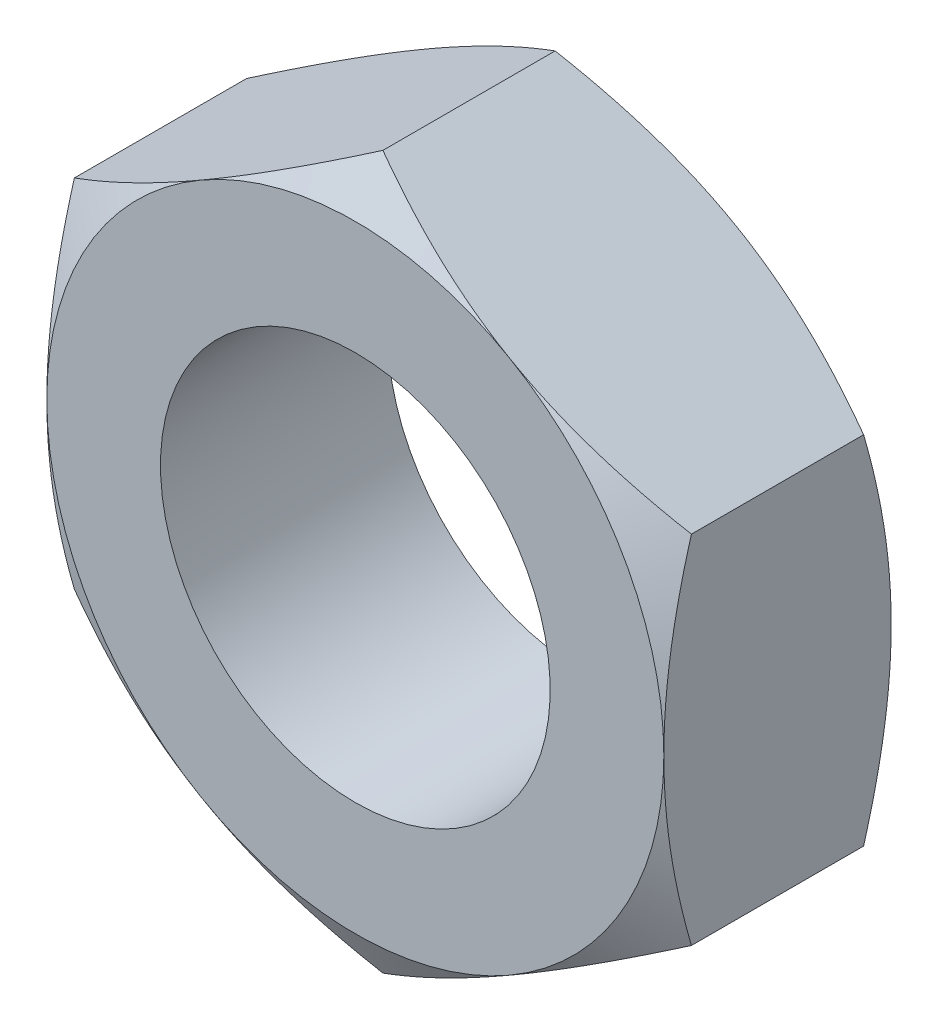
ISO-10303-21;
HEADER;
FILE_DESCRIPTION(('STEP AP214'),'2;1');
FILE_NAME('part.step','',(''),(''),'','','');
FILE_SCHEMA(('AUTOMOTIVE_DESIGN { 1 0 10303 214 1 1 1 1 }'));
ENDSEC;
DATA;
#1=APPLICATION_CONTEXT('core data for automotive mechanical design processes');
#2=APPLICATION_PROTOCOL_DEFINITION('international standard','automotive_design',2000,#1);
#3=PRODUCT_CONTEXT('',#1,'mechanical');
#4=PRODUCT('Part','Part','',(#3));
#5=PRODUCT_RELATED_PRODUCT_CATEGORY('part','',(#4));
#6=PRODUCT_DEFINITION_FORMATION('','',#4);
#7=PRODUCT_DEFINITION_CONTEXT('part definition',#1,'design');
#8=PRODUCT_DEFINITION('design','',#6,#7);
#9=PRODUCT_DEFINITION_SHAPE('','',#8);
#10=(LENGTH_UNIT() NAMED_UNIT(*) SI_UNIT(.MILLI.,.METRE.));
#11=(NAMED_UNIT(*) PLANE_ANGLE_UNIT() SI_UNIT($,.RADIAN.));
#12=(NAMED_UNIT(*) SI_UNIT($,.STERADIAN.) SOLID_ANGLE_UNIT());
#13=UNCERTAINTY_MEASURE_WITH_UNIT(LENGTH_MEASURE(1.E-05),#10,'distance_accuracy_value','');
#14=(GEOMETRIC_REPRESENTATION_CONTEXT(3) GLOBAL_UNCERTAINTY_ASSIGNED_CONTEXT((#13)) GLOBAL_UNIT_ASSIGNED_CONTEXT((#10,
#11,#12)) REPRESENTATION_CONTEXT('',''));
#15=CARTESIAN_POINT('',(0.,0.,0.));
#16=DIRECTION('',(0.,0.,1.));
#17=DIRECTION('',(1.,0.,0.));
#18=AXIS2_PLACEMENT_3D('',#15,#16,#17);
#19=CARTESIAN_POINT('',(-9.5,-5.48482755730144,10.));
#20=DIRECTION('',(-1.,0.,0.));
#21=DIRECTION('',(0.,0.,1.));
#22=AXIS2_PLACEMENT_3D('',#19,#20,#21);
#23=PLANE('',#22);
#24=CARTESIAN_POINT('',(-9.5,-14.7001628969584,4.62036564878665));
#25=CARTESIAN_POINT('',(-9.5,-14.4928471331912,4.519839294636));
#26=CARTESIAN_POINT('',(-9.5,-14.2852872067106,4.41981671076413));
#27=CARTESIAN_POINT('',(-9.5,-13.869628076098,4.22089324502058));
#28=CARTESIAN_POINT('',(-9.5,-13.6615288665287,4.12199237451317));
#29=CARTESIAN_POINT('',(-9.5,-13.0362900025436,3.82711729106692));
#30=CARTESIAN_POINT('',(-9.5,-12.6182709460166,3.6330006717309));
#31=CARTESIAN_POINT('',(-9.5,-11.7771337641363,3.24984888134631));
#32=CARTESIAN_POINT('',(-9.5,-11.354000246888,3.06084741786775));
#33=CARTESIAN_POINT('',(-9.5,-10.5043570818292,2.69061968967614));
#34=CARTESIAN_POINT('',(-9.5,-10.0778475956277,2.50939305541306));
#35=CARTESIAN_POINT('',(-9.5,-9.20711708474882,2.15115514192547));
#36=CARTESIAN_POINT('',(-9.5,-8.76276452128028,1.97446181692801));
#37=CARTESIAN_POINT('',(-9.5,-7.86884975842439,1.63452719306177));
#38=CARTESIAN_POINT('',(-9.5,-7.41928697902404,1.47128740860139));
#39=CARTESIAN_POINT('',(-9.5,-6.51508321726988,1.16257016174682));
#40=CARTESIAN_POINT('',(-9.5,-6.06045474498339,1.01705645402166));
#41=CARTESIAN_POINT('',(-9.5,-5.14469290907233,0.748480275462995));
#42=CARTESIAN_POINT('',(-9.5,-4.68356165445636,0.625410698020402));
#43=CARTESIAN_POINT('',(-9.5,-3.75701738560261,0.408313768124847));
#44=CARTESIAN_POINT('',(-9.5,-3.2916421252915,0.31412965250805));
#45=CARTESIAN_POINT('',(-9.5,-2.58936761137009,0.198609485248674));
#46=CARTESIAN_POINT('',(-9.5,-2.3545566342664,0.164393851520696));
#47=CARTESIAN_POINT('',(-9.5,-1.88377870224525,0.105219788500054));
#48=CARTESIAN_POINT('',(-9.5,-1.64781186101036,0.0802604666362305));
#49=CARTESIAN_POINT('',(-9.5,-1.17810612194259,0.0404075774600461));
#50=CARTESIAN_POINT('',(-9.5,-0.944377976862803,0.0253877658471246));
#51=CARTESIAN_POINT('',(-9.5,-0.476496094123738,0.00524322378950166));
#52=CARTESIAN_POINT('',(-9.5,-0.242342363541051,0.000118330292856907));
#53=CARTESIAN_POINT('',(-9.5,0.225972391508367,-0.000114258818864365));
#54=CARTESIAN_POINT('',(-9.5,0.460133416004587,0.00477809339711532));
#55=CARTESIAN_POINT('',(-9.5,0.928042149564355,0.0244611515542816));
#56=CARTESIAN_POINT('',(-9.5,1.16178983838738,0.03925232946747));
#57=CARTESIAN_POINT('',(-9.5,1.72456481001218,0.0864680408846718));
#58=CARTESIAN_POINT('',(-9.5,2.05320029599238,0.12364510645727));
#59=CARTESIAN_POINT('',(-9.5,2.7080124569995,0.215533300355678));
#60=CARTESIAN_POINT('',(-9.5,3.03418878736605,0.270246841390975));
#61=CARTESIAN_POINT('',(-9.5,3.68377887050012,0.395261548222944));
#62=CARTESIAN_POINT('',(-9.5,4.0071902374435,0.465574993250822));
#63=CARTESIAN_POINT('',(-9.5,4.65075897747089,0.619645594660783));
#64=CARTESIAN_POINT('',(-9.5,4.97091640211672,0.703402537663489));
#65=CARTESIAN_POINT('',(-9.5,5.61497508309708,0.884291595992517));
#66=CARTESIAN_POINT('',(-9.5,5.93880489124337,0.981676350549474));
#67=CARTESIAN_POINT('',(-9.5,6.58327415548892,1.18643170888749));
#68=CARTESIAN_POINT('',(-9.5,6.90391359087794,1.29380237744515));
#69=CARTESIAN_POINT('',(-9.5,7.54216168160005,1.51683145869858));
#70=CARTESIAN_POINT('',(-9.5,7.85977132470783,1.63248705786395));
#71=CARTESIAN_POINT('',(-9.5,8.49236415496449,1.87073285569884));
#72=CARTESIAN_POINT('',(-9.5,8.80734736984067,1.99332298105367));
#73=CARTESIAN_POINT('',(-9.5,9.53798536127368,2.28547163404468));
#74=CARTESIAN_POINT('',(-9.5,9.95275460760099,2.45724117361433));
#75=CARTESIAN_POINT('',(-9.5,10.778861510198,2.80886574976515));
#76=CARTESIAN_POINT('',(-9.5,11.1901989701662,2.98872124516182));
#77=CARTESIAN_POINT('',(-9.5,12.0100639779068,3.3549345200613));
#78=CARTESIAN_POINT('',(-9.5,12.4185909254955,3.54129363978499));
#79=CARTESIAN_POINT('',(-9.5,13.2332072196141,3.9192325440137));
#80=CARTESIAN_POINT('',(-9.5,13.6392966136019,4.11081222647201));
#81=CARTESIAN_POINT('',(-9.5,14.4498532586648,4.49843576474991));
#82=CARTESIAN_POINT('',(-9.5,14.8543183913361,4.69448404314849));
#83=CARTESIAN_POINT('',(-9.5,15.6615189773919,5.09010804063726));
#84=CARTESIAN_POINT('',(-9.5,16.0642544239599,5.2896837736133));
#85=CARTESIAN_POINT('',(-9.5,17.2701751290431,5.89273467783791));
#86=CARTESIAN_POINT('',(-9.5,18.0711740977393,6.30058144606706));
#87=CARTESIAN_POINT('',(-9.5,19.6039406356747,7.09102572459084));
#88=CARTESIAN_POINT('',(-9.5,20.3360415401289,7.47297970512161));
#89=CARTESIAN_POINT('',(-9.5,21.7974964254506,8.24216123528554));
#90=CARTESIAN_POINT('',(-9.5,22.5268503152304,8.62938895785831));
#91=CARTESIAN_POINT('',(-9.5,23.9816684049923,9.40694561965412));
#92=CARTESIAN_POINT('',(-9.5,24.7071377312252,9.79726498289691));
#93=CARTESIAN_POINT('',(-9.5,26.1563120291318,10.5810756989));
#94=CARTESIAN_POINT('',(-9.5,26.8800170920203,10.9745668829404));
#95=CARTESIAN_POINT('',(-9.5,27.6030690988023,11.3692463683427));
#96=B_SPLINE_CURVE_WITH_KNOTS('',3,(#24,#25,#26,#27,#28,#29,#30,#31,#32,#33,#34,#35,#36,#37,#38,
#39,#40,#41,#42,#43,#44,#45,#46,#47,#48,#49,#50,#51,#52,#53,#54,#55,#56,#57,#58,#59,#60,#61,#62,
#63,#64,#65,#66,#67,#68,#69,#70,#71,#72,#73,#74,#75,#76,#77,#78,#79,#80,#81,#82,#83,#84,#85,#86,
#87,#88,#89,#90,#91,#92,#93,#94,#95),.UNSPECIFIED.,.F.,.F.,(4,2,2,2,2,2,2,2,2,2,2,2,2,2,2,2,2,2,
2,2,2,2,2,2,2,2,2,2,2,2,2,2,2,2,2,4),(0.,0.691206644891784,1.38242028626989,2.76505382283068,
4.1552702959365,5.54542061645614,6.97983441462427,8.41440945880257,9.84600008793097,
11.2771366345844,12.7003629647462,13.4120814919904,14.1237313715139,14.8261594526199,
15.5285759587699,16.2309958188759,16.9334491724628,17.9250946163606,18.9168765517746,
19.909441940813,20.9019915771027,21.916267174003,22.9305493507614,23.9444886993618,
24.9584173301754,26.3050929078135,27.6518449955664,28.9988762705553,30.3458812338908,
31.6942827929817,33.0426896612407,35.739172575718,38.2163950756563,40.693699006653,
43.165106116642,45.6363826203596),.UNSPECIFIED.);
#97=CARTESIAN_POINT('',(-9.5,-5.48482755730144,0.848505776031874));
#98=VERTEX_POINT('',#97);
#99=CARTESIAN_POINT('',(-9.5,0.,0.));
#100=VERTEX_POINT('',#99);
#101=EDGE_CURVE('E137',#98,#100,#96,.T.);
#102=ORIENTED_EDGE('',*,*,#101,.F.);
#103=DIRECTION('',(0.,0.,-1.));
#104=VECTOR('',#103,1.);
#105=CARTESIAN_POINT('',(-9.5,-5.48482755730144,10.));
#106=LINE('',#105,#104);
#107=CARTESIAN_POINT('',(-9.5,-5.48482755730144,6.15149422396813));
#108=VERTEX_POINT('',#107);
#109=EDGE_CURVE('E266',#108,#98,#106,.T.);
#110=ORIENTED_EDGE('',*,*,#109,.F.);
#111=CARTESIAN_POINT('',(-9.5,-14.7001628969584,2.37963435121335));
#112=CARTESIAN_POINT('',(-9.5,-14.4928471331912,2.48016070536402));
#113=CARTESIAN_POINT('',(-9.5,-14.2852872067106,2.58018328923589));
#114=CARTESIAN_POINT('',(-9.5,-13.869628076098,2.77910675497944));
#115=CARTESIAN_POINT('',(-9.5,-13.6615288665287,2.87800762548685));
#116=CARTESIAN_POINT('',(-9.5,-13.0362900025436,3.1728827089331));
#117=CARTESIAN_POINT('',(-9.5,-12.6182709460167,3.36699932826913));
#118=CARTESIAN_POINT('',(-9.5,-11.7771337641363,3.75015111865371));
#119=CARTESIAN_POINT('',(-9.5,-11.354000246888,3.93915258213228));
#120=CARTESIAN_POINT('',(-9.5,-10.5043570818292,4.30938031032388));
#121=CARTESIAN_POINT('',(-9.5,-10.0778475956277,4.49060694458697));
#122=CARTESIAN_POINT('',(-9.5,-9.20711708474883,4.84884485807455));
#123=CARTESIAN_POINT('',(-9.5,-8.76276452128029,5.02553818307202));
#124=CARTESIAN_POINT('',(-9.5,-7.8688497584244,5.36547280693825));
#125=CARTESIAN_POINT('',(-9.5,-7.41928697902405,5.52871259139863));
#126=CARTESIAN_POINT('',(-9.5,-6.5150832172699,5.8374298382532));
#127=CARTESIAN_POINT('',(-9.5,-6.06045474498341,5.98294354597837));
#128=CARTESIAN_POINT('',(-9.5,-5.14469290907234,6.25151972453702));
#129=CARTESIAN_POINT('',(-9.5,-4.68356165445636,6.3745893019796));
#130=CARTESIAN_POINT('',(-9.5,-3.75701738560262,6.59168623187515));
#131=CARTESIAN_POINT('',(-9.5,-3.2916421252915,6.68587034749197));
#132=CARTESIAN_POINT('',(-9.5,-2.5893676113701,6.80139051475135));
#133=CARTESIAN_POINT('',(-9.5,-2.3545566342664,6.83560614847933));
#134=CARTESIAN_POINT('',(-9.5,-1.88377870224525,6.89478021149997));
#135=CARTESIAN_POINT('',(-9.5,-1.64781186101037,6.91973953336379));
#136=CARTESIAN_POINT('',(-9.5,-1.17810612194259,6.95959242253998));
#137=CARTESIAN_POINT('',(-9.5,-0.944377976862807,6.9746122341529));
#138=CARTESIAN_POINT('',(-9.5,-0.476496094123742,6.99475677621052));
#139=CARTESIAN_POINT('',(-9.5,-0.242342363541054,6.99988166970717));
#140=CARTESIAN_POINT('',(-9.5,0.225972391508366,7.00011425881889));
#141=CARTESIAN_POINT('',(-9.5,0.460133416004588,6.99522190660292));
#142=CARTESIAN_POINT('',(-9.5,0.928042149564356,6.97553884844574));
#143=CARTESIAN_POINT('',(-9.5,1.16178983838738,6.96074767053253));
#144=CARTESIAN_POINT('',(-9.5,1.72456481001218,6.91353195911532));
#145=CARTESIAN_POINT('',(-9.5,2.05320029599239,6.87635489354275));
#146=CARTESIAN_POINT('',(-9.5,2.70801245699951,6.78446669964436));
#147=CARTESIAN_POINT('',(-9.5,3.03418878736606,6.72975315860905));
#148=CARTESIAN_POINT('',(-9.5,3.68377887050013,6.60473845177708));
#149=CARTESIAN_POINT('',(-9.5,4.00719023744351,6.5344250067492));
#150=CARTESIAN_POINT('',(-9.5,4.6507589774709,6.38035440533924));
#151=CARTESIAN_POINT('',(-9.5,4.97091640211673,6.29659746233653));
#152=CARTESIAN_POINT('',(-9.5,5.61497508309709,6.11570840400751));
#153=CARTESIAN_POINT('',(-9.5,5.93880489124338,6.01832364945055));
#154=CARTESIAN_POINT('',(-9.5,6.58327415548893,5.81356829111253));
#155=CARTESIAN_POINT('',(-9.5,6.90391359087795,5.70619762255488));
#156=CARTESIAN_POINT('',(-9.5,7.54216168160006,5.48316854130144));
#157=CARTESIAN_POINT('',(-9.5,7.85977132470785,5.36751294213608));
#158=CARTESIAN_POINT('',(-9.5,8.4923641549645,5.12926714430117));
#159=CARTESIAN_POINT('',(-9.5,8.80734736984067,5.00667701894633));
#160=CARTESIAN_POINT('',(-9.5,9.53798536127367,4.71452836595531));
#161=CARTESIAN_POINT('',(-9.5,9.95275460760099,4.54275882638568));
#162=CARTESIAN_POINT('',(-9.5,10.778861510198,4.19113425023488));
#163=CARTESIAN_POINT('',(-9.5,11.1901989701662,4.0112787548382));
#164=CARTESIAN_POINT('',(-9.5,12.0100639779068,3.64506547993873));
#165=CARTESIAN_POINT('',(-9.5,12.4185909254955,3.45870636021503));
#166=CARTESIAN_POINT('',(-9.5,13.2332072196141,3.08076745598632));
#167=CARTESIAN_POINT('',(-9.5,13.639296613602,2.88918777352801));
#168=CARTESIAN_POINT('',(-9.5,14.4498532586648,2.50156423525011));
#169=CARTESIAN_POINT('',(-9.5,14.8543183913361,2.30551595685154));
#170=CARTESIAN_POINT('',(-9.5,15.6615189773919,1.90989195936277));
#171=CARTESIAN_POINT('',(-9.5,16.0642544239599,1.71031622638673));
#172=CARTESIAN_POINT('',(-9.5,17.2701751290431,1.10726532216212));
#173=CARTESIAN_POINT('',(-9.5,18.0711740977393,0.699418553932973));
#174=CARTESIAN_POINT('',(-9.5,19.6039406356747,-0.0910257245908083));
#175=CARTESIAN_POINT('',(-9.5,20.3360415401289,-0.472979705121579));
#176=CARTESIAN_POINT('',(-9.5,21.7974964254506,-1.24216123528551));
#177=CARTESIAN_POINT('',(-9.5,22.5268503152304,-1.62938895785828));
#178=CARTESIAN_POINT('',(-9.5,23.9816684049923,-2.40694561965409));
#179=CARTESIAN_POINT('',(-9.5,24.7071377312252,-2.79726498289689));
#180=CARTESIAN_POINT('',(-9.5,26.1563120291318,-3.58107569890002));
#181=CARTESIAN_POINT('',(-9.5,26.8800170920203,-3.97456688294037));
#182=CARTESIAN_POINT('',(-9.5,27.6030690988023,-4.36924636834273));
#183=B_SPLINE_CURVE_WITH_KNOTS('',3,(#111,#112,#113,#114,#115,#116,#117,#118,#119,#120,#121,
#122,#123,#124,#125,#126,#127,#128,#129,#130,#131,#132,#133,#134,#135,#136,#137,#138,#139,#140,
#141,#142,#143,#144,#145,#146,#147,#148,#149,#150,#151,#152,#153,#154,#155,#156,#157,#158,#159,
#160,#161,#162,#163,#164,#165,#166,#167,#168,#169,#170,#171,#172,#173,#174,#175,#176,#177,#178,
#179,#180,#181,#182),.UNSPECIFIED.,.F.,.F.,(4,2,2,2,2,2,2,2,2,2,2,2,2,2,2,2,2,2,2,2,2,2,2,2,2,2,
2,2,2,2,2,2,2,2,2,4),(0.,0.691206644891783,1.38242028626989,2.76505382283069,4.1552702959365,
5.54542061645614,6.97983441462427,8.41440945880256,9.84600008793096,11.2771366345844,
12.7003629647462,13.4120814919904,14.1237313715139,14.8261594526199,15.5285759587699,
16.2309958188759,16.9334491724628,17.9250946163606,18.9168765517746,19.909441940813,
20.9019915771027,21.916267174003,22.9305493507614,23.9444886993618,24.9584173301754,
26.3050929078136,27.6518449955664,28.9988762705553,30.3458812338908,31.6942827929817,
33.0426896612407,35.739172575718,38.2163950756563,40.693699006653,43.165106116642,
45.6363826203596),.UNSPECIFIED.);
#184=CARTESIAN_POINT('',(-9.5,0.,7.));
#185=VERTEX_POINT('',#184);
#186=EDGE_CURVE('E220',#185,#108,#183,.F.);
#187=ORIENTED_EDGE('',*,*,#186,.F.);
#188=CARTESIAN_POINT('',(-9.5,5.48482755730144,6.15149422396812));
#189=VERTEX_POINT('',#188);
#190=EDGE_CURVE('E206',#189,#185,#183,.F.);
#191=ORIENTED_EDGE('',*,*,#190,.F.);
#192=DIRECTION('',(0.,0.,-1.));
#193=VECTOR('',#192,1.);
#194=CARTESIAN_POINT('',(-9.5,5.48482755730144,10.));
#195=LINE('',#194,#193);
#196=CARTESIAN_POINT('',(-9.5,5.48482755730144,0.848505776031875));
#197=VERTEX_POINT('',#196);
#198=EDGE_CURVE('E260',#189,#197,#195,.T.);
#199=ORIENTED_EDGE('',*,*,#198,.T.);
#200=EDGE_CURVE('E115',#100,#197,#96,.T.);
#201=ORIENTED_EDGE('',*,*,#200,.F.);
#202=EDGE_LOOP('',(#102,#110,#187,#191,#199,#201));
#203=FACE_BOUND('',#202,.T.);
#204=ADVANCED_FACE('F14',(#203),#23,.T.);
#205=CARTESIAN_POINT('',(-9.5,-5.48482755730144,10.));
#206=DIRECTION('',(0.5,0.86602540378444,0.));
#207=DIRECTION('',(-0.86602540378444,0.5,0.));
#208=AXIS2_PLACEMENT_3D('',#205,#206,#207);
#209=PLANE('',#208);
#210=ORIENTED_EDGE('',*,*,#109,.T.);
#211=CARTESIAN_POINT('',(-9.5002,-5.4847120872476,0.848572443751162));
#212=CARTESIAN_POINT('',(-9.2913692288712,-5.60528058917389,0.778973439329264));
#213=CARTESIAN_POINT('',(-9.08175982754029,-5.72629863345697,0.71253330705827));
#214=CARTESIAN_POINT('',(-8.66086011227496,-5.96930519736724,0.586847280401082));
#215=CARTESIAN_POINT('',(-8.44956926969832,-6.09129402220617,0.527603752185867));
#216=CARTESIAN_POINT('',(-7.81229220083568,-6.45922610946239,0.361814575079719));
#217=CARTESIAN_POINT('',(-7.38379023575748,-6.70662183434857,0.267514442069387));
#218=CARTESIAN_POINT('',(-6.74255666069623,-7.07683821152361,0.156938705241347));
#219=CARTESIAN_POINT('',(-6.53174078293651,-7.19855281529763,0.125439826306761));
#220=CARTESIAN_POINT('',(-6.10913296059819,-7.4425455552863,0.0726182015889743));
#221=CARTESIAN_POINT('',(-5.89734099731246,-7.56482370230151,0.0512956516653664));
#222=CARTESIAN_POINT('',(-5.47340378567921,-7.80958396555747,0.0193730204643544));
#223=CARTESIAN_POINT('',(-5.26125925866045,-7.93206566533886,0.00876019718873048));
#224=CARTESIAN_POINT('',(-4.83677424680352,-8.17714220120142,-0.00151746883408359));
#225=CARTESIAN_POINT('',(-4.62443376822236,-8.2997370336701,-0.00118264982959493));
#226=CARTESIAN_POINT('',(-4.22745800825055,-8.52893109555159,0.00967336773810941));
#227=CARTESIAN_POINT('',(-4.04279470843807,-8.63554650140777,0.0188702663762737));
#228=CARTESIAN_POINT('',(-3.67389999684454,-8.84852796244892,0.0453653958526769));
#229=CARTESIAN_POINT('',(-3.48966861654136,-8.95489399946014,0.0626641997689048));
#230=CARTESIAN_POINT('',(-2.937688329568,-9.27357996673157,0.126304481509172));
#231=CARTESIAN_POINT('',(-2.57091646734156,-9.48533580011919,0.184381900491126));
#232=CARTESIAN_POINT('',(-1.83348217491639,-9.91109368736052,0.329576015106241));
#233=CARTESIAN_POINT('',(-1.46291385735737,-10.1250414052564,0.417308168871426));
#234=CARTESIAN_POINT('',(-0.727303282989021,-10.5497463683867,0.616423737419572));
#235=CARTESIAN_POINT('',(-0.362251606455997,-10.7605090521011,0.72776038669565));
#236=CARTESIAN_POINT('',(0.000200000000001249,-10.9697705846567,0.848572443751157));
#237=B_SPLINE_CURVE_WITH_KNOTS('',3,(#211,#212,#213,#214,#215,#216,#217,#218,#219,#220,#221,
#222,#223,#224,#225,#226,#227,#228,#229,#230,#231,#232,#233,#234,#235,#236),.UNSPECIFIED.,.F.,
.F.,(4,2,2,2,2,2,2,2,2,2,2,2,4),(0.,0.752880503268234,1.50600787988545,3.01546870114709,
3.75167336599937,4.48789219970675,5.22323407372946,5.95855322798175,6.5986808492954,
7.23885375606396,8.52010929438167,9.82978009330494,11.1368800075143),.UNSPECIFIED.);
#238=CARTESIAN_POINT('',(-4.75,-8.22724133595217,0.));
#239=VERTEX_POINT('',#238);
#240=EDGE_CURVE('E138',#98,#239,#237,.T.);
#241=ORIENTED_EDGE('',*,*,#240,.T.);
#242=CARTESIAN_POINT('',(0.,-10.9696551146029,0.848505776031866));
#243=VERTEX_POINT('',#242);
#244=EDGE_CURVE('E123',#239,#243,#237,.T.);
#245=ORIENTED_EDGE('',*,*,#244,.T.);
#246=DIRECTION('',(0.,0.,-1.));
#247=VECTOR('',#246,1.);
#248=CARTESIAN_POINT('',(0.,-10.9696551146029,10.));
#249=LINE('',#248,#247);
#250=CARTESIAN_POINT('',(0.,-10.9696551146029,6.15149422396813));
#251=VERTEX_POINT('',#250);
#252=EDGE_CURVE('E136',#251,#243,#249,.T.);
#253=ORIENTED_EDGE('',*,*,#252,.F.);
#254=CARTESIAN_POINT('',(0.000200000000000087,-10.9697705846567,6.15142755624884));
#255=CARTESIAN_POINT('',(-0.208630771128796,-10.8492020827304,6.22102656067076));
#256=CARTESIAN_POINT('',(-0.418240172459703,-10.7281840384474,6.28746669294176));
#257=CARTESIAN_POINT('',(-0.83913988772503,-10.4851774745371,6.41315271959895));
#258=CARTESIAN_POINT('',(-1.05043073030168,-10.3631886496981,6.47239624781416));
#259=CARTESIAN_POINT('',(-1.68770779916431,-9.99525656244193,6.63818542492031));
#260=CARTESIAN_POINT('',(-2.11620976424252,-9.74786083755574,6.73248555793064));
#261=CARTESIAN_POINT('',(-2.75744333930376,-9.37764446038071,6.84306129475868));
#262=CARTESIAN_POINT('',(-2.96825921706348,-9.25592985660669,6.87456017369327));
#263=CARTESIAN_POINT('',(-3.39086703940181,-9.01193711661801,6.92738179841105));
#264=CARTESIAN_POINT('',(-3.60265900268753,-8.8896589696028,6.94870434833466));
#265=CARTESIAN_POINT('',(-4.02659621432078,-8.64489870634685,6.98062697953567));
#266=CARTESIAN_POINT('',(-4.23874074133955,-8.52241700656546,6.9912398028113));
#267=CARTESIAN_POINT('',(-4.66322575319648,-8.2773404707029,7.0015174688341));
#268=CARTESIAN_POINT('',(-4.87556623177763,-8.15474563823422,7.00118264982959));
#269=CARTESIAN_POINT('',(-5.27254199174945,-7.92555157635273,6.99032663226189));
#270=CARTESIAN_POINT('',(-5.45720529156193,-7.81893617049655,6.98112973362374));
#271=CARTESIAN_POINT('',(-5.82610000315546,-7.60595470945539,6.95463460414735));
#272=CARTESIAN_POINT('',(-6.01033138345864,-7.49958867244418,6.93733580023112));
#273=CARTESIAN_POINT('',(-6.562311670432,-7.18090270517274,6.87369551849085));
#274=CARTESIAN_POINT('',(-6.92908353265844,-6.96914687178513,6.81561809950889));
#275=CARTESIAN_POINT('',(-7.66651782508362,-6.54338898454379,6.67042398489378));
#276=CARTESIAN_POINT('',(-8.03708614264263,-6.32944126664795,6.5826918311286));
#277=CARTESIAN_POINT('',(-8.77269671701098,-5.90473630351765,6.38357626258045));
#278=CARTESIAN_POINT('',(-9.137748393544,-5.69397361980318,6.27223961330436));
#279=CARTESIAN_POINT('',(-9.5002,-5.4847120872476,6.15142755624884));
#280=B_SPLINE_CURVE_WITH_KNOTS('',3,(#254,#255,#256,#257,#258,#259,#260,#261,#262,#263,#264,
#265,#266,#267,#268,#269,#270,#271,#272,#273,#274,#275,#276,#277,#278,#279),.UNSPECIFIED.,.F.,
.F.,(4,2,2,2,2,2,2,2,2,2,2,2,4),(0.,0.752880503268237,1.50600787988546,3.0154687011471,
3.75167336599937,4.48789219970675,5.22323407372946,5.95855322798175,6.59868084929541,
7.23885375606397,8.52010929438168,9.82978009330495,11.1368800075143),.UNSPECIFIED.);
#281=CARTESIAN_POINT('',(-4.75,-8.22724133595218,7.));
#282=VERTEX_POINT('',#281);
#283=EDGE_CURVE('E257',#251,#282,#280,.T.);
#284=ORIENTED_EDGE('',*,*,#283,.T.);
#285=EDGE_CURVE('E263',#282,#108,#280,.T.);
#286=ORIENTED_EDGE('',*,*,#285,.T.);
#287=EDGE_LOOP('',(#210,#241,#245,#253,#284,#286));
#288=FACE_BOUND('',#287,.T.);
#289=ADVANCED_FACE('F16',(#288),#209,.F.);
#290=CARTESIAN_POINT('',(9.5,-5.48482755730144,10.));
#291=DIRECTION('',(0.5,-0.86602540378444,0.));
#292=DIRECTION('',(0.86602540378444,0.5,0.));
#293=AXIS2_PLACEMENT_3D('',#290,#291,#292);
#294=PLANE('',#293);
#295=CARTESIAN_POINT('',(9.5002,-5.4847120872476,0.848572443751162));
#296=CARTESIAN_POINT('',(9.2913692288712,-5.60528058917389,0.778973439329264));
#297=CARTESIAN_POINT('',(9.08175982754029,-5.72629863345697,0.71253330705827));
#298=CARTESIAN_POINT('',(8.66086011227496,-5.96930519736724,0.586847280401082));
#299=CARTESIAN_POINT('',(8.44956926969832,-6.09129402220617,0.527603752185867));
#300=CARTESIAN_POINT('',(7.81229220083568,-6.45922610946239,0.361814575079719));
#301=CARTESIAN_POINT('',(7.38379023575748,-6.70662183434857,0.267514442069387));
#302=CARTESIAN_POINT('',(6.74255666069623,-7.07683821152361,0.156938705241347));
#303=CARTESIAN_POINT('',(6.53174078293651,-7.19855281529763,0.125439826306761));
#304=CARTESIAN_POINT('',(6.10913296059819,-7.4425455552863,0.0726182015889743));
#305=CARTESIAN_POINT('',(5.89734099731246,-7.56482370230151,0.0512956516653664));
#306=CARTESIAN_POINT('',(5.47340378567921,-7.80958396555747,0.0193730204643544));
#307=CARTESIAN_POINT('',(5.26125925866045,-7.93206566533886,0.00876019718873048));
#308=CARTESIAN_POINT('',(4.83677424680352,-8.17714220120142,-0.00151746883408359));
#309=CARTESIAN_POINT('',(4.62443376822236,-8.2997370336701,-0.00118264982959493));
#310=CARTESIAN_POINT('',(4.22745800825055,-8.52893109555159,0.00967336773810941));
#311=CARTESIAN_POINT('',(4.04279470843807,-8.63554650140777,0.0188702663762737));
#312=CARTESIAN_POINT('',(3.67389999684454,-8.84852796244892,0.0453653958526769));
#313=CARTESIAN_POINT('',(3.48966861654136,-8.95489399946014,0.0626641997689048));
#314=CARTESIAN_POINT('',(2.937688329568,-9.27357996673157,0.126304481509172));
#315=CARTESIAN_POINT('',(2.57091646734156,-9.48533580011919,0.184381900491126));
#316=CARTESIAN_POINT('',(1.83348217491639,-9.91109368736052,0.329576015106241));
#317=CARTESIAN_POINT('',(1.46291385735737,-10.1250414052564,0.417308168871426));
#318=CARTESIAN_POINT('',(0.727303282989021,-10.5497463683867,0.616423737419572));
#319=CARTESIAN_POINT('',(0.362251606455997,-10.7605090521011,0.72776038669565));
#320=CARTESIAN_POINT('',(-0.000200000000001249,-10.9697705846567,0.848572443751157));
#321=B_SPLINE_CURVE_WITH_KNOTS('',3,(#295,#296,#297,#298,#299,#300,#301,#302,#303,#304,#305,
#306,#307,#308,#309,#310,#311,#312,#313,#314,#315,#316,#317,#318,#319,#320),.UNSPECIFIED.,.F.,
.F.,(4,2,2,2,2,2,2,2,2,2,2,2,4),(0.,0.752880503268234,1.50600787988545,3.01546870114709,
3.75167336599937,4.48789219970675,5.22323407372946,5.95855322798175,6.5986808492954,
7.23885375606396,8.52010929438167,9.82978009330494,11.1368800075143),.UNSPECIFIED.);
#322=CARTESIAN_POINT('',(9.5,-5.48482755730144,0.848505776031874));
#323=VERTEX_POINT('',#322);
#324=CARTESIAN_POINT('',(4.75,-8.22724133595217,0.));
#325=VERTEX_POINT('',#324);
#326=EDGE_CURVE('E104',#323,#325,#321,.T.);
#327=ORIENTED_EDGE('',*,*,#326,.F.);
#328=DIRECTION('',(0.,0.,-1.));
#329=VECTOR('',#328,1.);
#330=CARTESIAN_POINT('',(9.5,-5.48482755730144,10.));
#331=LINE('',#330,#329);
#332=CARTESIAN_POINT('',(9.5,-5.48482755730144,6.15149422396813));
#333=VERTEX_POINT('',#332);
#334=EDGE_CURVE('E294',#333,#323,#331,.T.);
#335=ORIENTED_EDGE('',*,*,#334,.F.);
#336=CARTESIAN_POINT('',(-0.000199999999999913,-10.9697705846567,6.15142755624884));
#337=CARTESIAN_POINT('',(0.208630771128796,-10.8492020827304,6.22102656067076));
#338=CARTESIAN_POINT('',(0.418240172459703,-10.7281840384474,6.28746669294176));
#339=CARTESIAN_POINT('',(0.83913988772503,-10.4851774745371,6.41315271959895));
#340=CARTESIAN_POINT('',(1.05043073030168,-10.3631886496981,6.47239624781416));
#341=CARTESIAN_POINT('',(1.68770779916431,-9.99525656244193,6.63818542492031));
#342=CARTESIAN_POINT('',(2.11620976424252,-9.74786083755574,6.73248555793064));
#343=CARTESIAN_POINT('',(2.75744333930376,-9.37764446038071,6.84306129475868));
#344=CARTESIAN_POINT('',(2.96825921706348,-9.25592985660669,6.87456017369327));
#345=CARTESIAN_POINT('',(3.39086703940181,-9.01193711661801,6.92738179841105));
#346=CARTESIAN_POINT('',(3.60265900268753,-8.8896589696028,6.94870434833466));
#347=CARTESIAN_POINT('',(4.02659621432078,-8.64489870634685,6.98062697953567));
#348=CARTESIAN_POINT('',(4.23874074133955,-8.52241700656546,6.9912398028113));
#349=CARTESIAN_POINT('',(4.66322575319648,-8.2773404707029,7.0015174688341));
#350=CARTESIAN_POINT('',(4.87556623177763,-8.15474563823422,7.00118264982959));
#351=CARTESIAN_POINT('',(5.27254199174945,-7.92555157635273,6.99032663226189));
#352=CARTESIAN_POINT('',(5.45720529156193,-7.81893617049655,6.98112973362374));
#353=CARTESIAN_POINT('',(5.82610000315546,-7.60595470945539,6.95463460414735));
#354=CARTESIAN_POINT('',(6.01033138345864,-7.49958867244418,6.93733580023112));
#355=CARTESIAN_POINT('',(6.562311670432,-7.18090270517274,6.87369551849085));
#356=CARTESIAN_POINT('',(6.92908353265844,-6.96914687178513,6.81561809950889));
#357=CARTESIAN_POINT('',(7.66651782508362,-6.54338898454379,6.67042398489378));
#358=CARTESIAN_POINT('',(8.03708614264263,-6.32944126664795,6.5826918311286));
#359=CARTESIAN_POINT('',(8.77269671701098,-5.90473630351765,6.38357626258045));
#360=CARTESIAN_POINT('',(9.137748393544,-5.69397361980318,6.27223961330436));
#361=CARTESIAN_POINT('',(9.5002,-5.4847120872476,6.15142755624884));
#362=B_SPLINE_CURVE_WITH_KNOTS('',3,(#336,#337,#338,#339,#340,#341,#342,#343,#344,#345,#346,
#347,#348,#349,#350,#351,#352,#353,#354,#355,#356,#357,#358,#359,#360,#361),.UNSPECIFIED.,.F.,
.F.,(4,2,2,2,2,2,2,2,2,2,2,2,4),(0.,0.752880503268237,1.50600787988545,3.0154687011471,
3.75167336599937,4.48789219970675,5.22323407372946,5.95855322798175,6.59868084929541,
7.23885375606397,8.52010929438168,9.82978009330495,11.1368800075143),.UNSPECIFIED.);
#363=CARTESIAN_POINT('',(4.75,-8.22724133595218,7.));
#364=VERTEX_POINT('',#363);
#365=EDGE_CURVE('E308',#364,#333,#362,.T.);
#366=ORIENTED_EDGE('',*,*,#365,.F.);
#367=EDGE_CURVE('E284',#251,#364,#362,.T.);
#368=ORIENTED_EDGE('',*,*,#367,.F.);
#369=ORIENTED_EDGE('',*,*,#252,.T.);
#370=EDGE_CURVE('E117',#325,#243,#321,.T.);
#371=ORIENTED_EDGE('',*,*,#370,.F.);
#372=EDGE_LOOP('',(#327,#335,#366,#368,#369,#371));
#373=FACE_BOUND('',#372,.T.);
#374=ADVANCED_FACE('F133',(#373),#294,.T.);
#375=CARTESIAN_POINT('',(9.5,-5.48482755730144,10.));
#376=DIRECTION('',(-1.,0.,0.));
#377=DIRECTION('',(0.,0.,1.));
#378=AXIS2_PLACEMENT_3D('',#375,#376,#377);
#379=PLANE('',#378);
#380=ORIENTED_EDGE('',*,*,#334,.T.);
#381=CARTESIAN_POINT('',(9.5,-14.7001628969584,4.62036564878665));
#382=CARTESIAN_POINT('',(9.5,-14.4928471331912,4.519839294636));
#383=CARTESIAN_POINT('',(9.5,-14.2852872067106,4.41981671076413));
#384=CARTESIAN_POINT('',(9.5,-13.869628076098,4.22089324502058));
#385=CARTESIAN_POINT('',(9.5,-13.6615288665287,4.12199237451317));
#386=CARTESIAN_POINT('',(9.5,-13.0362900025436,3.82711729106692));
#387=CARTESIAN_POINT('',(9.5,-12.6182709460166,3.6330006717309));
#388=CARTESIAN_POINT('',(9.5,-11.7771337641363,3.24984888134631));
#389=CARTESIAN_POINT('',(9.5,-11.354000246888,3.06084741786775));
#390=CARTESIAN_POINT('',(9.5,-10.5043570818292,2.69061968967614));
#391=CARTESIAN_POINT('',(9.5,-10.0778475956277,2.50939305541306));
#392=CARTESIAN_POINT('',(9.5,-9.20711708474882,2.15115514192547));
#393=CARTESIAN_POINT('',(9.5,-8.76276452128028,1.97446181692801));
#394=CARTESIAN_POINT('',(9.5,-7.86884975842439,1.63452719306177));
#395=CARTESIAN_POINT('',(9.5,-7.41928697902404,1.47128740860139));
#396=CARTESIAN_POINT('',(9.5,-6.51508321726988,1.16257016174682));
#397=CARTESIAN_POINT('',(9.5,-6.06045474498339,1.01705645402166));
#398=CARTESIAN_POINT('',(9.5,-5.14469290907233,0.748480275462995));
#399=CARTESIAN_POINT('',(9.5,-4.68356165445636,0.625410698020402));
#400=CARTESIAN_POINT('',(9.5,-3.75701738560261,0.408313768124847));
#401=CARTESIAN_POINT('',(9.5,-3.2916421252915,0.31412965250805));
#402=CARTESIAN_POINT('',(9.5,-2.58936761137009,0.198609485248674));
#403=CARTESIAN_POINT('',(9.5,-2.3545566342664,0.164393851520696));
#404=CARTESIAN_POINT('',(9.5,-1.88377870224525,0.105219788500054));
#405=CARTESIAN_POINT('',(9.5,-1.64781186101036,0.0802604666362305));
#406=CARTESIAN_POINT('',(9.5,-1.17810612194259,0.0404075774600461));
#407=CARTESIAN_POINT('',(9.5,-0.944377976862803,0.0253877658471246));
#408=CARTESIAN_POINT('',(9.5,-0.476496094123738,0.00524322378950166));
#409=CARTESIAN_POINT('',(9.5,-0.242342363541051,0.000118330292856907));
#410=CARTESIAN_POINT('',(9.5,0.225972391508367,-0.000114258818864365));
#411=CARTESIAN_POINT('',(9.5,0.460133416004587,0.00477809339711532));
#412=CARTESIAN_POINT('',(9.5,0.928042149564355,0.0244611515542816));
#413=CARTESIAN_POINT('',(9.5,1.16178983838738,0.03925232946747));
#414=CARTESIAN_POINT('',(9.5,1.72456481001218,0.0864680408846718));
#415=CARTESIAN_POINT('',(9.5,2.05320029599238,0.12364510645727));
#416=CARTESIAN_POINT('',(9.5,2.7080124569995,0.215533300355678));
#417=CARTESIAN_POINT('',(9.5,3.03418878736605,0.270246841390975));
#418=CARTESIAN_POINT('',(9.5,3.68377887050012,0.395261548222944));
#419=CARTESIAN_POINT('',(9.5,4.0071902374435,0.465574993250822));
#420=CARTESIAN_POINT('',(9.5,4.65075897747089,0.619645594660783));
#421=CARTESIAN_POINT('',(9.5,4.97091640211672,0.703402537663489));
#422=CARTESIAN_POINT('',(9.5,5.61497508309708,0.884291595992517));
#423=CARTESIAN_POINT('',(9.5,5.93880489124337,0.981676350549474));
#424=CARTESIAN_POINT('',(9.5,6.58327415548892,1.18643170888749));
#425=CARTESIAN_POINT('',(9.5,6.90391359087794,1.29380237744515));
#426=CARTESIAN_POINT('',(9.5,7.54216168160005,1.51683145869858));
#427=CARTESIAN_POINT('',(9.5,7.85977132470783,1.63248705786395));
#428=CARTESIAN_POINT('',(9.5,8.49236415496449,1.87073285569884));
#429=CARTESIAN_POINT('',(9.5,8.80734736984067,1.99332298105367));
#430=CARTESIAN_POINT('',(9.5,9.53798536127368,2.28547163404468));
#431=CARTESIAN_POINT('',(9.5,9.95275460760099,2.45724117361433));
#432=CARTESIAN_POINT('',(9.5,10.778861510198,2.80886574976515));
#433=CARTESIAN_POINT('',(9.5,11.1901989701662,2.98872124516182));
#434=CARTESIAN_POINT('',(9.5,12.0100639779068,3.3549345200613));
#435=CARTESIAN_POINT('',(9.5,12.4185909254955,3.54129363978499));
#436=CARTESIAN_POINT('',(9.5,13.2332072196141,3.9192325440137));
#437=CARTESIAN_POINT('',(9.5,13.6392966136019,4.11081222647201));
#438=CARTESIAN_POINT('',(9.5,14.4498532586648,4.49843576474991));
#439=CARTESIAN_POINT('',(9.5,14.8543183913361,4.69448404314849));
#440=CARTESIAN_POINT('',(9.5,15.6615189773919,5.09010804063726));
#441=CARTESIAN_POINT('',(9.5,16.0642544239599,5.2896837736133));
#442=CARTESIAN_POINT('',(9.5,17.2701751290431,5.89273467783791));
#443=CARTESIAN_POINT('',(9.5,18.0711740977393,6.30058144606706));
#444=CARTESIAN_POINT('',(9.5,19.6039406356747,7.09102572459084));
#445=CARTESIAN_POINT('',(9.5,20.3360415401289,7.47297970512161));
#446=CARTESIAN_POINT('',(9.5,21.7974964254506,8.24216123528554));
#447=CARTESIAN_POINT('',(9.5,22.5268503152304,8.62938895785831));
#448=CARTESIAN_POINT('',(9.5,23.9816684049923,9.40694561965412));
#449=CARTESIAN_POINT('',(9.5,24.7071377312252,9.79726498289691));
#450=CARTESIAN_POINT('',(9.5,26.1563120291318,10.5810756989));
#451=CARTESIAN_POINT('',(9.5,26.8800170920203,10.9745668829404));
#452=CARTESIAN_POINT('',(9.5,27.6030690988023,11.3692463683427));
#453=B_SPLINE_CURVE_WITH_KNOTS('',3,(#381,#382,#383,#384,#385,#386,#387,#388,#389,#390,#391,
#392,#393,#394,#395,#396,#397,#398,#399,#400,#401,#402,#403,#404,#405,#406,#407,#408,#409,#410,
#411,#412,#413,#414,#415,#416,#417,#418,#419,#420,#421,#422,#423,#424,#425,#426,#427,#428,#429,
#430,#431,#432,#433,#434,#435,#436,#437,#438,#439,#440,#441,#442,#443,#444,#445,#446,#447,#448,
#449,#450,#451,#452),.UNSPECIFIED.,.F.,.F.,(4,2,2,2,2,2,2,2,2,2,2,2,2,2,2,2,2,2,2,2,2,2,2,2,2,2,
2,2,2,2,2,2,2,2,2,4),(0.,0.691206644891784,1.38242028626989,2.76505382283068,4.1552702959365,
5.54542061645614,6.97983441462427,8.41440945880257,9.84600008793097,11.2771366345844,
12.7003629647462,13.4120814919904,14.1237313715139,14.8261594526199,15.5285759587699,
16.2309958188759,16.9334491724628,17.9250946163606,18.9168765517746,19.909441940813,
20.9019915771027,21.916267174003,22.9305493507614,23.9444886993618,24.9584173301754,
26.3050929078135,27.6518449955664,28.9988762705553,30.3458812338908,31.6942827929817,
33.0426896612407,35.739172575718,38.2163950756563,40.693699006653,43.165106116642,
45.6363826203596),.UNSPECIFIED.);
#454=CARTESIAN_POINT('',(9.5,0.,0.));
#455=VERTEX_POINT('',#454);
#456=EDGE_CURVE('E110',#323,#455,#453,.T.);
#457=ORIENTED_EDGE('',*,*,#456,.T.);
#458=CARTESIAN_POINT('',(9.5,5.48482755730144,0.848505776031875));
#459=VERTEX_POINT('',#458);
#460=EDGE_CURVE('E31',#455,#459,#453,.T.);
#461=ORIENTED_EDGE('',*,*,#460,.T.);
#462=DIRECTION('',(0.,0.,-1.));
#463=VECTOR('',#462,1.);
#464=CARTESIAN_POINT('',(9.5,5.48482755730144,10.));
#465=LINE('',#464,#463);
#466=CARTESIAN_POINT('',(9.5,5.48482755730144,6.15149422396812));
#467=VERTEX_POINT('',#466);
#468=EDGE_CURVE('E295',#467,#459,#465,.T.);
#469=ORIENTED_EDGE('',*,*,#468,.F.);
#470=CARTESIAN_POINT('',(9.5,-14.7001628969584,2.37963435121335));
#471=CARTESIAN_POINT('',(9.5,-14.4928471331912,2.48016070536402));
#472=CARTESIAN_POINT('',(9.5,-14.2852872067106,2.58018328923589));
#473=CARTESIAN_POINT('',(9.5,-13.869628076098,2.77910675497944));
#474=CARTESIAN_POINT('',(9.5,-13.6615288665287,2.87800762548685));
#475=CARTESIAN_POINT('',(9.5,-13.0362900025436,3.1728827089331));
#476=CARTESIAN_POINT('',(9.5,-12.6182709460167,3.36699932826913));
#477=CARTESIAN_POINT('',(9.5,-11.7771337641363,3.75015111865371));
#478=CARTESIAN_POINT('',(9.5,-11.354000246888,3.93915258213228));
#479=CARTESIAN_POINT('',(9.5,-10.5043570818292,4.30938031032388));
#480=CARTESIAN_POINT('',(9.5,-10.0778475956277,4.49060694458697));
#481=CARTESIAN_POINT('',(9.5,-9.20711708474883,4.84884485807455));
#482=CARTESIAN_POINT('',(9.5,-8.76276452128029,5.02553818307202));
#483=CARTESIAN_POINT('',(9.5,-7.8688497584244,5.36547280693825));
#484=CARTESIAN_POINT('',(9.5,-7.41928697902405,5.52871259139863));
#485=CARTESIAN_POINT('',(9.5,-6.5150832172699,5.8374298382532));
#486=CARTESIAN_POINT('',(9.5,-6.06045474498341,5.98294354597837));
#487=CARTESIAN_POINT('',(9.5,-5.14469290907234,6.25151972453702));
#488=CARTESIAN_POINT('',(9.5,-4.68356165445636,6.3745893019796));
#489=CARTESIAN_POINT('',(9.5,-3.75701738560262,6.59168623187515));
#490=CARTESIAN_POINT('',(9.5,-3.2916421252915,6.68587034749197));
#491=CARTESIAN_POINT('',(9.5,-2.5893676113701,6.80139051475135));
#492=CARTESIAN_POINT('',(9.5,-2.3545566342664,6.83560614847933));
#493=CARTESIAN_POINT('',(9.5,-1.88377870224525,6.89478021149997));
#494=CARTESIAN_POINT('',(9.5,-1.64781186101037,6.91973953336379));
#495=CARTESIAN_POINT('',(9.5,-1.17810612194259,6.95959242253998));
#496=CARTESIAN_POINT('',(9.5,-0.944377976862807,6.9746122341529));
#497=CARTESIAN_POINT('',(9.5,-0.476496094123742,6.99475677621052));
#498=CARTESIAN_POINT('',(9.5,-0.242342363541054,6.99988166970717));
#499=CARTESIAN_POINT('',(9.5,0.225972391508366,7.00011425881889));
#500=CARTESIAN_POINT('',(9.5,0.460133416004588,6.99522190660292));
#501=CARTESIAN_POINT('',(9.5,0.928042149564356,6.97553884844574));
#502=CARTESIAN_POINT('',(9.5,1.16178983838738,6.96074767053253));
#503=CARTESIAN_POINT('',(9.5,1.72456481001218,6.91353195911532));
#504=CARTESIAN_POINT('',(9.5,2.05320029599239,6.87635489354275));
#505=CARTESIAN_POINT('',(9.5,2.70801245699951,6.78446669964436));
#506=CARTESIAN_POINT('',(9.5,3.03418878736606,6.72975315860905));
#507=CARTESIAN_POINT('',(9.5,3.68377887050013,6.60473845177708));
#508=CARTESIAN_POINT('',(9.5,4.00719023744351,6.5344250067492));
#509=CARTESIAN_POINT('',(9.5,4.6507589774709,6.38035440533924));
#510=CARTESIAN_POINT('',(9.5,4.97091640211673,6.29659746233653));
#511=CARTESIAN_POINT('',(9.5,5.61497508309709,6.11570840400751));
#512=CARTESIAN_POINT('',(9.5,5.93880489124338,6.01832364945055));
#513=CARTESIAN_POINT('',(9.5,6.58327415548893,5.81356829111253));
#514=CARTESIAN_POINT('',(9.5,6.90391359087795,5.70619762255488));
#515=CARTESIAN_POINT('',(9.5,7.54216168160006,5.48316854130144));
#516=CARTESIAN_POINT('',(9.5,7.85977132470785,5.36751294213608));
#517=CARTESIAN_POINT('',(9.5,8.4923641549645,5.12926714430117));
#518=CARTESIAN_POINT('',(9.5,8.80734736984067,5.00667701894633));
#519=CARTESIAN_POINT('',(9.5,9.53798536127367,4.71452836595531));
#520=CARTESIAN_POINT('',(9.5,9.95275460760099,4.54275882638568));
#521=CARTESIAN_POINT('',(9.5,10.778861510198,4.19113425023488));
#522=CARTESIAN_POINT('',(9.5,11.1901989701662,4.0112787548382));
#523=CARTESIAN_POINT('',(9.5,12.0100639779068,3.64506547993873));
#524=CARTESIAN_POINT('',(9.5,12.4185909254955,3.45870636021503));
#525=CARTESIAN_POINT('',(9.5,13.2332072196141,3.08076745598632));
#526=CARTESIAN_POINT('',(9.5,13.639296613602,2.88918777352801));
#527=CARTESIAN_POINT('',(9.5,14.4498532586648,2.50156423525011));
#528=CARTESIAN_POINT('',(9.5,14.8543183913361,2.30551595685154));
#529=CARTESIAN_POINT('',(9.5,15.6615189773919,1.90989195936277));
#530=CARTESIAN_POINT('',(9.5,16.0642544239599,1.71031622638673));
#531=CARTESIAN_POINT('',(9.5,17.2701751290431,1.10726532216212));
#532=CARTESIAN_POINT('',(9.5,18.0711740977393,0.699418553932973));
#533=CARTESIAN_POINT('',(9.5,19.6039406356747,-0.0910257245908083));
#534=CARTESIAN_POINT('',(9.5,20.3360415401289,-0.472979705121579));
#535=CARTESIAN_POINT('',(9.5,21.7974964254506,-1.24216123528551));
#536=CARTESIAN_POINT('',(9.5,22.5268503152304,-1.62938895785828));
#537=CARTESIAN_POINT('',(9.5,23.9816684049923,-2.40694561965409));
#538=CARTESIAN_POINT('',(9.5,24.7071377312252,-2.79726498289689));
#539=CARTESIAN_POINT('',(9.5,26.1563120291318,-3.58107569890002));
#540=CARTESIAN_POINT('',(9.5,26.8800170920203,-3.97456688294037));
#541=CARTESIAN_POINT('',(9.5,27.6030690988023,-4.36924636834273));
#542=B_SPLINE_CURVE_WITH_KNOTS('',3,(#470,#471,#472,#473,#474,#475,#476,#477,#478,#479,#480,
#481,#482,#483,#484,#485,#486,#487,#488,#489,#490,#491,#492,#493,#494,#495,#496,#497,#498,#499,
#500,#501,#502,#503,#504,#505,#506,#507,#508,#509,#510,#511,#512,#513,#514,#515,#516,#517,#518,
#519,#520,#521,#522,#523,#524,#525,#526,#527,#528,#529,#530,#531,#532,#533,#534,#535,#536,#537,
#538,#539,#540,#541),.UNSPECIFIED.,.F.,.F.,(4,2,2,2,2,2,2,2,2,2,2,2,2,2,2,2,2,2,2,2,2,2,2,2,2,2,
2,2,2,2,2,2,2,2,2,4),(0.,0.691206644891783,1.38242028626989,2.76505382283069,4.1552702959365,
5.54542061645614,6.97983441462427,8.41440945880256,9.84600008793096,11.2771366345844,
12.7003629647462,13.4120814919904,14.1237313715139,14.8261594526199,15.5285759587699,
16.2309958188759,16.9334491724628,17.9250946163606,18.9168765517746,19.909441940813,
20.9019915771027,21.916267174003,22.9305493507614,23.9444886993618,24.9584173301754,
26.3050929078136,27.6518449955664,28.9988762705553,30.3458812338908,31.6942827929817,
33.0426896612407,35.739172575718,38.2163950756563,40.693699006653,43.165106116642,
45.6363826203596),.UNSPECIFIED.);
#543=CARTESIAN_POINT('',(9.5,0.,7.));
#544=VERTEX_POINT('',#543);
#545=EDGE_CURVE('E221',#467,#544,#542,.F.);
#546=ORIENTED_EDGE('',*,*,#545,.T.);
#547=EDGE_CURVE('E313',#544,#333,#542,.F.);
#548=ORIENTED_EDGE('',*,*,#547,.T.);
#549=EDGE_LOOP('',(#380,#457,#461,#469,#546,#548));
#550=FACE_BOUND('',#549,.T.);
#551=ADVANCED_FACE('F192',(#550),#379,.F.);
#552=CARTESIAN_POINT('',(9.5,5.48482755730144,10.));
#553=DIRECTION('',(-0.5,-0.86602540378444,0.));
#554=DIRECTION('',(0.86602540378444,-0.5,0.));
#555=AXIS2_PLACEMENT_3D('',#552,#553,#554);
#556=PLANE('',#555);
#557=ORIENTED_EDGE('',*,*,#468,.T.);
#558=CARTESIAN_POINT('',(9.5002,5.4847120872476,0.848572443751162));
#559=CARTESIAN_POINT('',(9.2913692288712,5.60528058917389,0.778973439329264));
#560=CARTESIAN_POINT('',(9.08175982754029,5.72629863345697,0.71253330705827));
#561=CARTESIAN_POINT('',(8.66086011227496,5.96930519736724,0.586847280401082));
#562=CARTESIAN_POINT('',(8.44956926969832,6.09129402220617,0.527603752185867));
#563=CARTESIAN_POINT('',(7.81229220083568,6.45922610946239,0.361814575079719));
#564=CARTESIAN_POINT('',(7.38379023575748,6.70662183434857,0.267514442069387));
#565=CARTESIAN_POINT('',(6.74255666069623,7.07683821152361,0.156938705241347));
#566=CARTESIAN_POINT('',(6.53174078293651,7.19855281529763,0.125439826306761));
#567=CARTESIAN_POINT('',(6.10913296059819,7.4425455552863,0.0726182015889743));
#568=CARTESIAN_POINT('',(5.89734099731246,7.56482370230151,0.0512956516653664));
#569=CARTESIAN_POINT('',(5.47340378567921,7.80958396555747,0.0193730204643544));
#570=CARTESIAN_POINT('',(5.26125925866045,7.93206566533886,0.00876019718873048));
#571=CARTESIAN_POINT('',(4.83677424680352,8.17714220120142,-0.00151746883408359));
#572=CARTESIAN_POINT('',(4.62443376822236,8.2997370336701,-0.00118264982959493));
#573=CARTESIAN_POINT('',(4.22745800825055,8.52893109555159,0.00967336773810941));
#574=CARTESIAN_POINT('',(4.04279470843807,8.63554650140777,0.0188702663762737));
#575=CARTESIAN_POINT('',(3.67389999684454,8.84852796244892,0.0453653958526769));
#576=CARTESIAN_POINT('',(3.48966861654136,8.95489399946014,0.0626641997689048));
#577=CARTESIAN_POINT('',(2.937688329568,9.27357996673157,0.126304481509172));
#578=CARTESIAN_POINT('',(2.57091646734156,9.48533580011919,0.184381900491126));
#579=CARTESIAN_POINT('',(1.83348217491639,9.91109368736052,0.329576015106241));
#580=CARTESIAN_POINT('',(1.46291385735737,10.1250414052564,0.417308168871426));
#581=CARTESIAN_POINT('',(0.727303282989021,10.5497463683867,0.616423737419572));
#582=CARTESIAN_POINT('',(0.362251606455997,10.7605090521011,0.72776038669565));
#583=CARTESIAN_POINT('',(-0.000200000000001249,10.9697705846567,0.848572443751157));
#584=B_SPLINE_CURVE_WITH_KNOTS('',3,(#558,#559,#560,#561,#562,#563,#564,#565,#566,#567,#568,
#569,#570,#571,#572,#573,#574,#575,#576,#577,#578,#579,#580,#581,#582,#583),.UNSPECIFIED.,.F.,
.F.,(4,2,2,2,2,2,2,2,2,2,2,2,4),(0.,0.752880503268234,1.50600787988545,3.01546870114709,
3.75167336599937,4.48789219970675,5.22323407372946,5.95855322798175,6.5986808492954,
7.23885375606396,8.52010929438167,9.82978009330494,11.1368800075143),.UNSPECIFIED.);
#585=CARTESIAN_POINT('',(4.75,8.22724133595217,0.));
#586=VERTEX_POINT('',#585);
#587=EDGE_CURVE('E186',#459,#586,#584,.T.);
#588=ORIENTED_EDGE('',*,*,#587,.T.);
#589=CARTESIAN_POINT('',(0.,10.9696551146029,0.848505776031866));
#590=VERTEX_POINT('',#589);
#591=EDGE_CURVE('E38',#586,#590,#584,.T.);
#592=ORIENTED_EDGE('',*,*,#591,.T.);
#593=DIRECTION('',(0.,0.,-1.));
#594=VECTOR('',#593,1.);
#595=CARTESIAN_POINT('',(0.,10.9696551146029,10.));
#596=LINE('',#595,#594);
#597=CARTESIAN_POINT('',(0.,10.9696551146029,6.15149422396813));
#598=VERTEX_POINT('',#597);
#599=EDGE_CURVE('E300',#598,#590,#596,.T.);
#600=ORIENTED_EDGE('',*,*,#599,.F.);
#601=CARTESIAN_POINT('',(-0.000199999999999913,10.9697705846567,6.15142755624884));
#602=CARTESIAN_POINT('',(0.208630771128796,10.8492020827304,6.22102656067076));
#603=CARTESIAN_POINT('',(0.418240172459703,10.7281840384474,6.28746669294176));
#604=CARTESIAN_POINT('',(0.83913988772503,10.4851774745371,6.41315271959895));
#605=CARTESIAN_POINT('',(1.05043073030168,10.3631886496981,6.47239624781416));
#606=CARTESIAN_POINT('',(1.68770779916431,9.99525656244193,6.63818542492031));
#607=CARTESIAN_POINT('',(2.11620976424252,9.74786083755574,6.73248555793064));
#608=CARTESIAN_POINT('',(2.75744333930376,9.37764446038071,6.84306129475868));
#609=CARTESIAN_POINT('',(2.96825921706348,9.25592985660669,6.87456017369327));
#610=CARTESIAN_POINT('',(3.39086703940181,9.01193711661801,6.92738179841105));
#611=CARTESIAN_POINT('',(3.60265900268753,8.8896589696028,6.94870434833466));
#612=CARTESIAN_POINT('',(4.02659621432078,8.64489870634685,6.98062697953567));
#613=CARTESIAN_POINT('',(4.23874074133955,8.52241700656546,6.9912398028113));
#614=CARTESIAN_POINT('',(4.66322575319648,8.2773404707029,7.0015174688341));
#615=CARTESIAN_POINT('',(4.87556623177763,8.15474563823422,7.00118264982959));
#616=CARTESIAN_POINT('',(5.27254199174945,7.92555157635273,6.99032663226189));
#617=CARTESIAN_POINT('',(5.45720529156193,7.81893617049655,6.98112973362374));
#618=CARTESIAN_POINT('',(5.82610000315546,7.60595470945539,6.95463460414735));
#619=CARTESIAN_POINT('',(6.01033138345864,7.49958867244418,6.93733580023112));
#620=CARTESIAN_POINT('',(6.562311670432,7.18090270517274,6.87369551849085));
#621=CARTESIAN_POINT('',(6.92908353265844,6.96914687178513,6.81561809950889));
#622=CARTESIAN_POINT('',(7.66651782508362,6.54338898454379,6.67042398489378));
#623=CARTESIAN_POINT('',(8.03708614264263,6.32944126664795,6.5826918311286));
#624=CARTESIAN_POINT('',(8.77269671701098,5.90473630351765,6.38357626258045));
#625=CARTESIAN_POINT('',(9.137748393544,5.69397361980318,6.27223961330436));
#626=CARTESIAN_POINT('',(9.5002,5.4847120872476,6.15142755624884));
#627=B_SPLINE_CURVE_WITH_KNOTS('',3,(#601,#602,#603,#604,#605,#606,#607,#608,#609,#610,#611,
#612,#613,#614,#615,#616,#617,#618,#619,#620,#621,#622,#623,#624,#625,#626),.UNSPECIFIED.,.F.,
.F.,(4,2,2,2,2,2,2,2,2,2,2,2,4),(0.,0.752880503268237,1.50600787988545,3.0154687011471,
3.75167336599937,4.48789219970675,5.22323407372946,5.95855322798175,6.59868084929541,
7.23885375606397,8.52010929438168,9.82978009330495,11.1368800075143),.UNSPECIFIED.);
#628=CARTESIAN_POINT('',(4.75,8.22724133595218,7.));
#629=VERTEX_POINT('',#628);
#630=EDGE_CURVE('E198',#598,#629,#627,.T.);
#631=ORIENTED_EDGE('',*,*,#630,.T.);
#632=EDGE_CURVE('E208',#629,#467,#627,.T.);
#633=ORIENTED_EDGE('',*,*,#632,.T.);
#634=EDGE_LOOP('',(#557,#588,#592,#600,#631,#633));
#635=FACE_BOUND('',#634,.T.);
#636=ADVANCED_FACE('F188',(#635),#556,.F.);
#637=CARTESIAN_POINT('',(-9.5,5.48482755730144,10.));
#638=DIRECTION('',(-0.5,0.86602540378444,0.));
#639=DIRECTION('',(-0.86602540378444,-0.5,0.));
#640=AXIS2_PLACEMENT_3D('',#637,#638,#639);
#641=PLANE('',#640);
#642=CARTESIAN_POINT('',(-9.5002,5.4847120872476,0.848572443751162));
#643=CARTESIAN_POINT('',(-9.2913692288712,5.60528058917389,0.778973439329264));
#644=CARTESIAN_POINT('',(-9.08175982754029,5.72629863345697,0.71253330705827));
#645=CARTESIAN_POINT('',(-8.66086011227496,5.96930519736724,0.586847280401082));
#646=CARTESIAN_POINT('',(-8.44956926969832,6.09129402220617,0.527603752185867));
#647=CARTESIAN_POINT('',(-7.81229220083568,6.45922610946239,0.361814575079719));
#648=CARTESIAN_POINT('',(-7.38379023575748,6.70662183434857,0.267514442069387));
#649=CARTESIAN_POINT('',(-6.74255666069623,7.07683821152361,0.156938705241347));
#650=CARTESIAN_POINT('',(-6.53174078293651,7.19855281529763,0.125439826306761));
#651=CARTESIAN_POINT('',(-6.10913296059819,7.4425455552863,0.0726182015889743));
#652=CARTESIAN_POINT('',(-5.89734099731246,7.56482370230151,0.0512956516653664));
#653=CARTESIAN_POINT('',(-5.47340378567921,7.80958396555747,0.0193730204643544));
#654=CARTESIAN_POINT('',(-5.26125925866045,7.93206566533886,0.00876019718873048));
#655=CARTESIAN_POINT('',(-4.83677424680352,8.17714220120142,-0.00151746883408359));
#656=CARTESIAN_POINT('',(-4.62443376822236,8.2997370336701,-0.00118264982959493));
#657=CARTESIAN_POINT('',(-4.22745800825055,8.52893109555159,0.00967336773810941));
#658=CARTESIAN_POINT('',(-4.04279470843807,8.63554650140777,0.0188702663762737));
#659=CARTESIAN_POINT('',(-3.67389999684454,8.84852796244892,0.0453653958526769));
#660=CARTESIAN_POINT('',(-3.48966861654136,8.95489399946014,0.0626641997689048));
#661=CARTESIAN_POINT('',(-2.937688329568,9.27357996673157,0.126304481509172));
#662=CARTESIAN_POINT('',(-2.57091646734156,9.48533580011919,0.184381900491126));
#663=CARTESIAN_POINT('',(-1.83348217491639,9.91109368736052,0.329576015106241));
#664=CARTESIAN_POINT('',(-1.46291385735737,10.1250414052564,0.417308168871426));
#665=CARTESIAN_POINT('',(-0.727303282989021,10.5497463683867,0.616423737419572));
#666=CARTESIAN_POINT('',(-0.362251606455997,10.7605090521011,0.72776038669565));
#667=CARTESIAN_POINT('',(0.000200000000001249,10.9697705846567,0.848572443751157));
#668=B_SPLINE_CURVE_WITH_KNOTS('',3,(#642,#643,#644,#645,#646,#647,#648,#649,#650,#651,#652,
#653,#654,#655,#656,#657,#658,#659,#660,#661,#662,#663,#664,#665,#666,#667),.UNSPECIFIED.,.F.,
.F.,(4,2,2,2,2,2,2,2,2,2,2,2,4),(0.,0.752880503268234,1.50600787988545,3.01546870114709,
3.75167336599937,4.48789219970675,5.22323407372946,5.95855322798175,6.5986808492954,
7.23885375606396,8.52010929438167,9.82978009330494,11.1368800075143),.UNSPECIFIED.);
#669=CARTESIAN_POINT('',(-4.75,8.22724133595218,0.));
#670=VERTEX_POINT('',#669);
#671=EDGE_CURVE('E187',#197,#670,#668,.T.);
#672=ORIENTED_EDGE('',*,*,#671,.F.);
#673=ORIENTED_EDGE('',*,*,#198,.F.);
#674=CARTESIAN_POINT('',(0.000200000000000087,10.9697705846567,6.15142755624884));
#675=CARTESIAN_POINT('',(-0.208630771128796,10.8492020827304,6.22102656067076));
#676=CARTESIAN_POINT('',(-0.418240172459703,10.7281840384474,6.28746669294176));
#677=CARTESIAN_POINT('',(-0.83913988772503,10.4851774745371,6.41315271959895));
#678=CARTESIAN_POINT('',(-1.05043073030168,10.3631886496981,6.47239624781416));
#679=CARTESIAN_POINT('',(-1.68770779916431,9.99525656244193,6.63818542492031));
#680=CARTESIAN_POINT('',(-2.11620976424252,9.74786083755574,6.73248555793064));
#681=CARTESIAN_POINT('',(-2.75744333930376,9.37764446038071,6.84306129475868));
#682=CARTESIAN_POINT('',(-2.96825921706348,9.25592985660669,6.87456017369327));
#683=CARTESIAN_POINT('',(-3.39086703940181,9.01193711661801,6.92738179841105));
#684=CARTESIAN_POINT('',(-3.60265900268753,8.8896589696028,6.94870434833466));
#685=CARTESIAN_POINT('',(-4.02659621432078,8.64489870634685,6.98062697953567));
#686=CARTESIAN_POINT('',(-4.23874074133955,8.52241700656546,6.9912398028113));
#687=CARTESIAN_POINT('',(-4.66322575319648,8.2773404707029,7.0015174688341));
#688=CARTESIAN_POINT('',(-4.87556623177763,8.15474563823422,7.00118264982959));
#689=CARTESIAN_POINT('',(-5.27254199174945,7.92555157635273,6.99032663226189));
#690=CARTESIAN_POINT('',(-5.45720529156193,7.81893617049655,6.98112973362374));
#691=CARTESIAN_POINT('',(-5.82610000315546,7.60595470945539,6.95463460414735));
#692=CARTESIAN_POINT('',(-6.01033138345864,7.49958867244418,6.93733580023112));
#693=CARTESIAN_POINT('',(-6.562311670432,7.18090270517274,6.87369551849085));
#694=CARTESIAN_POINT('',(-6.92908353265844,6.96914687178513,6.81561809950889));
#695=CARTESIAN_POINT('',(-7.66651782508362,6.54338898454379,6.67042398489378));
#696=CARTESIAN_POINT('',(-8.03708614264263,6.32944126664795,6.5826918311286));
#697=CARTESIAN_POINT('',(-8.77269671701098,5.90473630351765,6.38357626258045));
#698=CARTESIAN_POINT('',(-9.137748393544,5.69397361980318,6.27223961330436));
#699=CARTESIAN_POINT('',(-9.5002,5.4847120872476,6.15142755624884));
#700=B_SPLINE_CURVE_WITH_KNOTS('',3,(#674,#675,#676,#677,#678,#679,#680,#681,#682,#683,#684,
#685,#686,#687,#688,#689,#690,#691,#692,#693,#694,#695,#696,#697,#698,#699),.UNSPECIFIED.,.F.,
.F.,(4,2,2,2,2,2,2,2,2,2,2,2,4),(0.,0.752880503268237,1.50600787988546,3.0154687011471,
3.75167336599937,4.48789219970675,5.22323407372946,5.95855322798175,6.59868084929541,
7.23885375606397,8.52010929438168,9.82978009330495,11.1368800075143),.UNSPECIFIED.);
#701=CARTESIAN_POINT('',(-4.75,8.22724133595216,7.));
#702=VERTEX_POINT('',#701);
#703=EDGE_CURVE('E209',#702,#189,#700,.T.);
#704=ORIENTED_EDGE('',*,*,#703,.F.);
#705=EDGE_CURVE('E207',#598,#702,#700,.T.);
#706=ORIENTED_EDGE('',*,*,#705,.F.);
#707=ORIENTED_EDGE('',*,*,#599,.T.);
#708=EDGE_CURVE('E171',#670,#590,#668,.T.);
#709=ORIENTED_EDGE('',*,*,#708,.F.);
#710=EDGE_LOOP('',(#672,#673,#704,#706,#707,#709));
#711=FACE_BOUND('',#710,.T.);
#712=ADVANCED_FACE('F191',(#711),#641,.T.);
#713=CARTESIAN_POINT('',(0.,0.,10.));
#714=DIRECTION('',(0.,0.,-1.));
#715=DIRECTION('',(0.,-1.,0.));
#716=AXIS2_PLACEMENT_3D('',#713,#714,#715);
#717=CYLINDRICAL_SURFACE('',#716,6.);
#718=CARTESIAN_POINT('',(0.,0.,0.));
#719=DIRECTION('',(0.,0.,-1.));
#720=DIRECTION('',(0.,-1.,0.));
#721=AXIS2_PLACEMENT_3D('',#718,#719,#720);
#722=CIRCLE('',#721,6.);
#723=CARTESIAN_POINT('',(0.,-6.,0.));
#724=VERTEX_POINT('',#723);
#725=EDGE_CURVE('E256',#724,#724,#722,.T.);
#726=ORIENTED_EDGE('',*,*,#725,.T.);
#727=EDGE_LOOP('',(#726));
#728=FACE_BOUND('',#727,.T.);
#729=CARTESIAN_POINT('',(0.,0.,7.));
#730=DIRECTION('',(0.,0.,1.));
#731=DIRECTION('',(0.,1.,0.));
#732=AXIS2_PLACEMENT_3D('',#729,#730,#731);
#733=CIRCLE('',#732,6.);
#734=CARTESIAN_POINT('',(0.,6.,7.));
#735=VERTEX_POINT('',#734);
#736=EDGE_CURVE('E254',#735,#735,#733,.F.);
#737=ORIENTED_EDGE('',*,*,#736,.F.);
#738=EDGE_LOOP('',(#737));
#739=FACE_BOUND('',#738,.T.);
#740=ADVANCED_FACE('F235',(#728,#739),#717,.F.);
#741=CARTESIAN_POINT('',(-9.5,5.48482755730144,0.));
#742=DIRECTION('',(0.,0.,-1.));
#743=DIRECTION('',(0.,-1.,0.));
#744=AXIS2_PLACEMENT_3D('',#741,#742,#743);
#745=PLANE('',#744);
#746=CARTESIAN_POINT('',(0.,0.,0.));
#747=DIRECTION('',(0.,0.,-1.));
#748=DIRECTION('',(0.,-1.,0.));
#749=AXIS2_PLACEMENT_3D('',#746,#747,#748);
#750=CIRCLE('',#749,9.5);
#751=EDGE_CURVE('E9',#325,#455,#750,.F.);
#752=ORIENTED_EDGE('',*,*,#751,.F.);
#753=EDGE_CURVE('E19',#239,#325,#750,.F.);
#754=ORIENTED_EDGE('',*,*,#753,.F.);
#755=EDGE_CURVE('E127',#100,#239,#750,.F.);
#756=ORIENTED_EDGE('',*,*,#755,.F.);
#757=CARTESIAN_POINT('',(0.,0.,0.));
#758=DIRECTION('',(0.,0.,1.));
#759=DIRECTION('',(0.,1.,0.));
#760=AXIS2_PLACEMENT_3D('',#757,#758,#759);
#761=CIRCLE('',#760,9.5);
#762=EDGE_CURVE('E323',#670,#100,#761,.T.);
#763=ORIENTED_EDGE('',*,*,#762,.F.);
#764=EDGE_CURVE('E321',#586,#670,#750,.F.);
#765=ORIENTED_EDGE('',*,*,#764,.F.);
#766=EDGE_CURVE('E24',#455,#586,#750,.F.);
#767=ORIENTED_EDGE('',*,*,#766,.F.);
#768=EDGE_LOOP('',(#752,#754,#756,#763,#765,#767));
#769=FACE_BOUND('',#768,.T.);
#770=ORIENTED_EDGE('',*,*,#725,.F.);
#771=EDGE_LOOP('',(#770));
#772=FACE_BOUND('',#771,.T.);
#773=ADVANCED_FACE('F129',(#769,#772),#745,.T.);
#774=CARTESIAN_POINT('',(-9.5,5.48482755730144,7.));
#775=DIRECTION('',(0.,0.,1.));
#776=DIRECTION('',(0.,1.,0.));
#777=AXIS2_PLACEMENT_3D('',#774,#775,#776);
#778=PLANE('',#777);
#779=CARTESIAN_POINT('',(0.,0.,7.));
#780=DIRECTION('',(0.,0.,1.));
#781=DIRECTION('',(0.,1.,0.));
#782=AXIS2_PLACEMENT_3D('',#779,#780,#781);
#783=CIRCLE('',#782,9.5);
#784=EDGE_CURVE('E128',#629,#544,#783,.F.);
#785=ORIENTED_EDGE('',*,*,#784,.F.);
#786=EDGE_CURVE('E268',#702,#629,#783,.F.);
#787=ORIENTED_EDGE('',*,*,#786,.F.);
#788=CARTESIAN_POINT('',(0.,0.,7.));
#789=DIRECTION('',(0.,0.,1.));
#790=DIRECTION('',(0.,1.,0.));
#791=AXIS2_PLACEMENT_3D('',#788,#789,#790);
#792=CIRCLE('',#791,9.5);
#793=EDGE_CURVE('E288',#702,#185,#792,.T.);
#794=ORIENTED_EDGE('',*,*,#793,.T.);
#795=EDGE_CURVE('E270',#282,#185,#783,.F.);
#796=ORIENTED_EDGE('',*,*,#795,.F.);
#797=EDGE_CURVE('E273',#364,#282,#783,.F.);
#798=ORIENTED_EDGE('',*,*,#797,.F.);
#799=EDGE_CURVE('E275',#544,#364,#783,.F.);
#800=ORIENTED_EDGE('',*,*,#799,.F.);
#801=EDGE_LOOP('',(#785,#787,#794,#796,#798,#800));
#802=FACE_BOUND('',#801,.T.);
#803=ORIENTED_EDGE('',*,*,#736,.T.);
#804=EDGE_LOOP('',(#803));
#805=FACE_BOUND('',#804,.T.);
#806=ADVANCED_FACE('F234',(#802,#805),#778,.T.);
#807=CARTESIAN_POINT('',(0.,0.,5.04816824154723));
#808=DIRECTION('',(0.,0.,-1.));
#809=DIRECTION('',(0.,-1.,0.));
#810=AXIS2_PLACEMENT_3D('',#807,#808,#809);
#811=CONICAL_SURFACE('',#810,12.8806717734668,1.0471975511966);
#812=ORIENTED_EDGE('',*,*,#705,.T.);
#813=ORIENTED_EDGE('',*,*,#786,.T.);
#814=ORIENTED_EDGE('',*,*,#630,.F.);
#815=EDGE_LOOP('',(#812,#813,#814));
#816=FACE_BOUND('',#815,.T.);
#817=ADVANCED_FACE('F239',(#816),#811,.T.);
#818=ORIENTED_EDGE('',*,*,#190,.T.);
#819=ORIENTED_EDGE('',*,*,#793,.F.);
#820=ORIENTED_EDGE('',*,*,#703,.T.);
#821=EDGE_LOOP('',(#818,#819,#820));
#822=FACE_BOUND('',#821,.T.);
#823=ADVANCED_FACE('F165',(#822),#811,.T.);
#824=ORIENTED_EDGE('',*,*,#795,.T.);
#825=ORIENTED_EDGE('',*,*,#186,.T.);
#826=ORIENTED_EDGE('',*,*,#285,.F.);
#827=EDGE_LOOP('',(#824,#825,#826));
#828=FACE_BOUND('',#827,.T.);
#829=ADVANCED_FACE('F352',(#828),#811,.T.);
#830=ORIENTED_EDGE('',*,*,#367,.T.);
#831=ORIENTED_EDGE('',*,*,#797,.T.);
#832=ORIENTED_EDGE('',*,*,#283,.F.);
#833=EDGE_LOOP('',(#830,#831,#832));
#834=FACE_BOUND('',#833,.T.);
#835=ADVANCED_FACE('F283',(#834),#811,.T.);
#836=ORIENTED_EDGE('',*,*,#365,.T.);
#837=ORIENTED_EDGE('',*,*,#547,.F.);
#838=ORIENTED_EDGE('',*,*,#799,.T.);
#839=EDGE_LOOP('',(#836,#837,#838));
#840=FACE_BOUND('',#839,.T.);
#841=ADVANCED_FACE('F247',(#840),#811,.T.);
#842=ORIENTED_EDGE('',*,*,#632,.F.);
#843=ORIENTED_EDGE('',*,*,#784,.T.);
#844=ORIENTED_EDGE('',*,*,#545,.F.);
#845=EDGE_LOOP('',(#842,#843,#844));
#846=FACE_BOUND('',#845,.T.);
#847=ADVANCED_FACE('F347',(#846),#811,.T.);
#848=CARTESIAN_POINT('',(0.,0.,0.));
#849=DIRECTION('',(0.,0.,1.));
#850=DIRECTION('',(0.,1.,0.));
#851=AXIS2_PLACEMENT_3D('',#848,#849,#850);
#852=CONICAL_SURFACE('',#851,9.5,1.0471975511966);
#853=ORIENTED_EDGE('',*,*,#753,.T.);
#854=ORIENTED_EDGE('',*,*,#370,.T.);
#855=ORIENTED_EDGE('',*,*,#244,.F.);
#856=EDGE_LOOP('',(#853,#854,#855));
#857=FACE_BOUND('',#856,.T.);
#858=ADVANCED_FACE('F121',(#857),#852,.T.);
#859=ORIENTED_EDGE('',*,*,#101,.T.);
#860=ORIENTED_EDGE('',*,*,#755,.T.);
#861=ORIENTED_EDGE('',*,*,#240,.F.);
#862=EDGE_LOOP('',(#859,#860,#861));
#863=FACE_BOUND('',#862,.T.);
#864=ADVANCED_FACE('F163',(#863),#852,.T.);
#865=ORIENTED_EDGE('',*,*,#200,.T.);
#866=ORIENTED_EDGE('',*,*,#671,.T.);
#867=ORIENTED_EDGE('',*,*,#762,.T.);
#868=EDGE_LOOP('',(#865,#866,#867));
#869=FACE_BOUND('',#868,.T.);
#870=ADVANCED_FACE('F332',(#869),#852,.T.);
#871=ORIENTED_EDGE('',*,*,#764,.T.);
#872=ORIENTED_EDGE('',*,*,#708,.T.);
#873=ORIENTED_EDGE('',*,*,#591,.F.);
#874=EDGE_LOOP('',(#871,#872,#873));
#875=FACE_BOUND('',#874,.T.);
#876=ADVANCED_FACE('F164',(#875),#852,.T.);
#877=ORIENTED_EDGE('',*,*,#766,.T.);
#878=ORIENTED_EDGE('',*,*,#587,.F.);
#879=ORIENTED_EDGE('',*,*,#460,.F.);
#880=EDGE_LOOP('',(#877,#878,#879));
#881=FACE_BOUND('',#880,.T.);
#882=ADVANCED_FACE('F162',(#881),#852,.T.);
#883=ORIENTED_EDGE('',*,*,#326,.T.);
#884=ORIENTED_EDGE('',*,*,#751,.T.);
#885=ORIENTED_EDGE('',*,*,#456,.F.);
#886=EDGE_LOOP('',(#883,#884,#885));
#887=FACE_BOUND('',#886,.T.);
#888=ADVANCED_FACE('F106',(#887),#852,.T.);
#889=CLOSED_SHELL('',(#204,#289,#374,#551,#636,#712,#740,#773,#806,#817,#823,#829,#835,#841,
#847,#858,#864,#870,#876,#882,#888));
#890=MANIFOLD_SOLID_BREP('B1',#889);
#891=ADVANCED_BREP_SHAPE_REPRESENTATION('',(#18,#890),#14);
#892=SHAPE_DEFINITION_REPRESENTATION(#9,#891);
ENDSEC;
END-ISO-10303-21;
